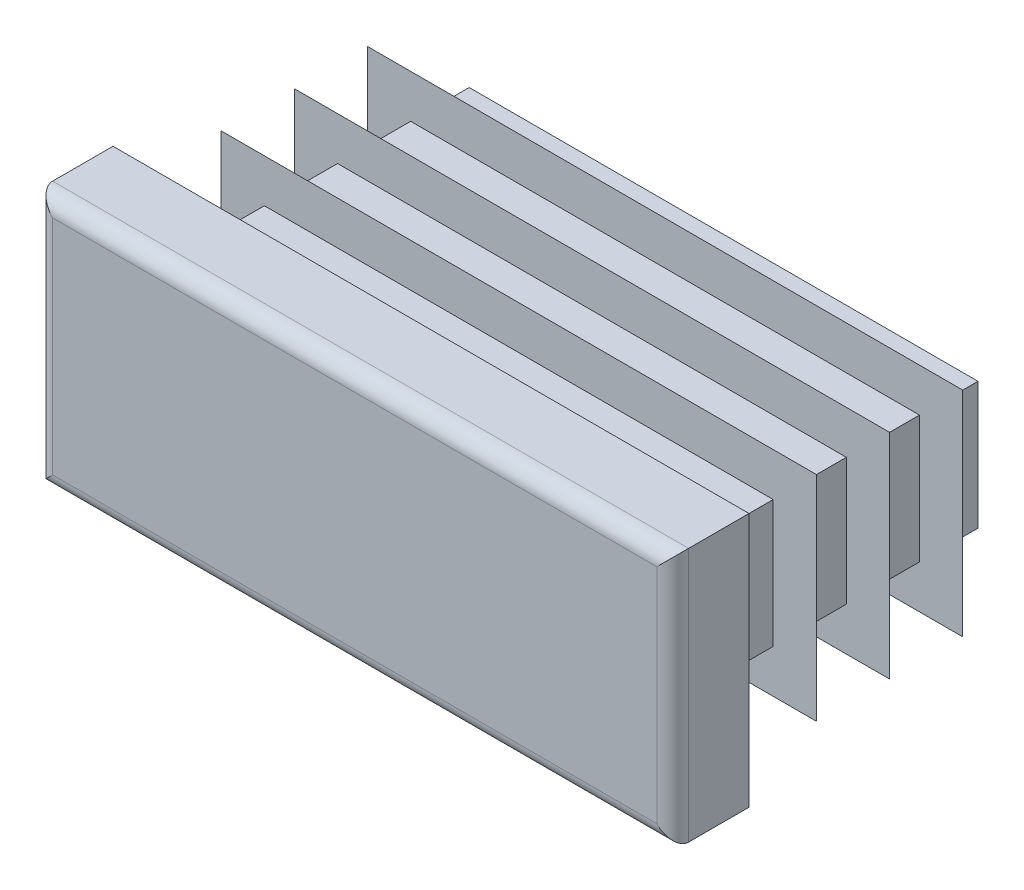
ISO-10303-21;
HEADER;
FILE_DESCRIPTION(('STEP AP214'),'2;1');
FILE_NAME('part.step','',(''),(''),'','','');
FILE_SCHEMA(('AUTOMOTIVE_DESIGN { 1 0 10303 214 1 1 1 1 }'));
ENDSEC;
DATA;
#1=APPLICATION_CONTEXT('core data for automotive mechanical design processes');
#2=APPLICATION_PROTOCOL_DEFINITION('international standard','automotive_design',2000,#1);
#3=PRODUCT_CONTEXT('',#1,'mechanical');
#4=PRODUCT('Part','Part','',(#3));
#5=PRODUCT_RELATED_PRODUCT_CATEGORY('part','',(#4));
#6=PRODUCT_DEFINITION_FORMATION('','',#4);
#7=PRODUCT_DEFINITION_CONTEXT('part definition',#1,'design');
#8=PRODUCT_DEFINITION('design','',#6,#7);
#9=PRODUCT_DEFINITION_SHAPE('','',#8);
#10=(LENGTH_UNIT() NAMED_UNIT(*) SI_UNIT(.MILLI.,.METRE.));
#11=(NAMED_UNIT(*) PLANE_ANGLE_UNIT() SI_UNIT($,.RADIAN.));
#12=(NAMED_UNIT(*) SI_UNIT($,.STERADIAN.) SOLID_ANGLE_UNIT());
#13=UNCERTAINTY_MEASURE_WITH_UNIT(LENGTH_MEASURE(1.E-05),#10,'distance_accuracy_value','');
#14=(GEOMETRIC_REPRESENTATION_CONTEXT(3) GLOBAL_UNCERTAINTY_ASSIGNED_CONTEXT((#13)) GLOBAL_UNIT_ASSIGNED_CONTEXT((#10,
#11,#12)) REPRESENTATION_CONTEXT('',''));
#15=CARTESIAN_POINT('',(0.,0.,0.));
#16=DIRECTION('',(0.,0.,1.));
#17=DIRECTION('',(1.,0.,0.));
#18=AXIS2_PLACEMENT_3D('',#15,#16,#17);
#19=CARTESIAN_POINT('',(11.875,-5.,3.));
#20=DIRECTION('',(0.,0.,-1.));
#21=DIRECTION('',(0.,1.,0.));
#22=AXIS2_PLACEMENT_3D('',#19,#20,#21);
#23=PLANE('',#22);
#24=DIRECTION('',(0.,1.,0.));
#25=VECTOR('',#24,1.);
#26=CARTESIAN_POINT('',(-11.875,-5.,3.));
#27=LINE('',#26,#25);
#28=CARTESIAN_POINT('',(-11.875,-4.375,3.));
#29=VERTEX_POINT('',#28);
#30=CARTESIAN_POINT('',(-11.875,4.375,3.));
#31=VERTEX_POINT('',#30);
#32=EDGE_CURVE('E310',#29,#31,#27,.T.);
#33=ORIENTED_EDGE('',*,*,#32,.F.);
#34=DIRECTION('',(-1.,0.,0.));
#35=VECTOR('',#34,1.);
#36=CARTESIAN_POINT('',(12.5,-4.375,3.));
#37=LINE('',#36,#35);
#38=CARTESIAN_POINT('',(11.875,-4.375,3.));
#39=VERTEX_POINT('',#38);
#40=EDGE_CURVE('E482',#39,#29,#37,.T.);
#41=ORIENTED_EDGE('',*,*,#40,.F.);
#42=DIRECTION('',(0.,1.,0.));
#43=VECTOR('',#42,1.);
#44=CARTESIAN_POINT('',(11.875,-5.,3.));
#45=LINE('',#44,#43);
#46=CARTESIAN_POINT('',(11.875,4.375,3.));
#47=VERTEX_POINT('',#46);
#48=EDGE_CURVE('E305',#39,#47,#45,.T.);
#49=ORIENTED_EDGE('',*,*,#48,.T.);
#50=DIRECTION('',(-1.,0.,0.));
#51=VECTOR('',#50,1.);
#52=CARTESIAN_POINT('',(12.5,4.375,3.));
#53=LINE('',#52,#51);
#54=EDGE_CURVE('E630',#47,#31,#53,.T.);
#55=ORIENTED_EDGE('',*,*,#54,.T.);
#56=EDGE_LOOP('',(#33,#41,#49,#55));
#57=FACE_BOUND('',#56,.T.);
#58=ADVANCED_FACE('F14',(#57),#23,.F.);
#59=CARTESIAN_POINT('',(-11.875,-5.,2.375));
#60=DIRECTION('',(0.,1.,0.));
#61=DIRECTION('',(-1.,0.,0.));
#62=AXIS2_PLACEMENT_3D('',#59,#60,#61);
#63=CYLINDRICAL_SURFACE('',#62,0.625);
#64=DIRECTION('',(0.,1.,0.));
#65=VECTOR('',#64,1.);
#66=CARTESIAN_POINT('',(-12.5,-5.,2.375));
#67=LINE('',#66,#65);
#68=CARTESIAN_POINT('',(-12.5,-5.,2.375));
#69=VERTEX_POINT('',#68);
#70=CARTESIAN_POINT('',(-12.5,5.,2.375));
#71=VERTEX_POINT('',#70);
#72=EDGE_CURVE('E402',#69,#71,#67,.T.);
#73=ORIENTED_EDGE('',*,*,#72,.F.);
#74=CARTESIAN_POINT('',(-11.875,-4.375,2.375));
#75=DIRECTION('',(-0.707106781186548,0.707106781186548,0.));
#76=DIRECTION('',(0.707106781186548,0.707106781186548,0.));
#77=AXIS2_PLACEMENT_3D('',#74,#75,#76);
#78=ELLIPSE('',#77,0.883883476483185,0.625);
#79=EDGE_CURVE('E59',#69,#29,#78,.T.);
#80=ORIENTED_EDGE('',*,*,#79,.T.);
#81=ORIENTED_EDGE('',*,*,#32,.T.);
#82=CARTESIAN_POINT('',(-11.875,4.375,2.375));
#83=DIRECTION('',(0.707106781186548,0.707106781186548,0.));
#84=DIRECTION('',(-0.707106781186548,0.707106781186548,0.));
#85=AXIS2_PLACEMENT_3D('',#82,#83,#84);
#86=ELLIPSE('',#85,0.883883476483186,0.625);
#87=EDGE_CURVE('E306',#31,#71,#86,.F.);
#88=ORIENTED_EDGE('',*,*,#87,.T.);
#89=EDGE_LOOP('',(#73,#80,#81,#88));
#90=FACE_BOUND('',#89,.T.);
#91=ADVANCED_FACE('F16',(#90),#63,.T.);
#92=CARTESIAN_POINT('',(-12.5,-5.,2.375));
#93=DIRECTION('',(1.,0.,0.));
#94=DIRECTION('',(0.,1.,0.));
#95=AXIS2_PLACEMENT_3D('',#92,#93,#94);
#96=PLANE('',#95);
#97=DIRECTION('',(0.,0.,-1.));
#98=VECTOR('',#97,1.);
#99=CARTESIAN_POINT('',(-12.5,5.,2.375));
#100=LINE('',#99,#98);
#101=CARTESIAN_POINT('',(-12.5,5.,0.));
#102=VERTEX_POINT('',#101);
#103=EDGE_CURVE('E615',#71,#102,#100,.T.);
#104=ORIENTED_EDGE('',*,*,#103,.T.);
#105=DIRECTION('',(0.,1.,0.));
#106=VECTOR('',#105,1.);
#107=CARTESIAN_POINT('',(-12.5,-5.,0.));
#108=LINE('',#107,#106);
#109=CARTESIAN_POINT('',(-12.5,-5.,0.));
#110=VERTEX_POINT('',#109);
#111=EDGE_CURVE('E400',#110,#102,#108,.T.);
#112=ORIENTED_EDGE('',*,*,#111,.F.);
#113=DIRECTION('',(0.,0.,-1.));
#114=VECTOR('',#113,1.);
#115=CARTESIAN_POINT('',(-12.5,-5.,2.375));
#116=LINE('',#115,#114);
#117=EDGE_CURVE('E616',#69,#110,#116,.T.);
#118=ORIENTED_EDGE('',*,*,#117,.F.);
#119=ORIENTED_EDGE('',*,*,#72,.T.);
#120=EDGE_LOOP('',(#104,#112,#118,#119));
#121=FACE_BOUND('',#120,.T.);
#122=ADVANCED_FACE('F697',(#121),#96,.F.);
#123=CARTESIAN_POINT('',(-10.,-5.,0.));
#124=DIRECTION('',(1.,0.,0.));
#125=DIRECTION('',(0.,1.,0.));
#126=AXIS2_PLACEMENT_3D('',#123,#124,#125);
#127=PLANE('',#126);
#128=DIRECTION('',(0.,1.,0.));
#129=VECTOR('',#128,1.);
#130=CARTESIAN_POINT('',(-10.,-5.,0.));
#131=LINE('',#130,#129);
#132=CARTESIAN_POINT('',(-10.,-2.5,0.));
#133=VERTEX_POINT('',#132);
#134=CARTESIAN_POINT('',(-10.,2.5,0.));
#135=VERTEX_POINT('',#134);
#136=EDGE_CURVE('E397',#133,#135,#131,.T.);
#137=ORIENTED_EDGE('',*,*,#136,.T.);
#138=DIRECTION('',(0.,0.,-1.));
#139=VECTOR('',#138,1.);
#140=CARTESIAN_POINT('',(-10.,2.5,0.));
#141=LINE('',#140,#139);
#142=CARTESIAN_POINT('',(-10.,2.5,-0.575));
#143=VERTEX_POINT('',#142);
#144=EDGE_CURVE('E495',#135,#143,#141,.T.);
#145=ORIENTED_EDGE('',*,*,#144,.T.);
#146=DIRECTION('',(0.,1.,0.));
#147=VECTOR('',#146,1.);
#148=CARTESIAN_POINT('',(-10.,-5.,-0.575));
#149=LINE('',#148,#147);
#150=CARTESIAN_POINT('',(-10.,-2.5,-0.575));
#151=VERTEX_POINT('',#150);
#152=EDGE_CURVE('E394',#151,#143,#149,.T.);
#153=ORIENTED_EDGE('',*,*,#152,.F.);
#154=DIRECTION('',(0.,0.,1.));
#155=VECTOR('',#154,1.);
#156=CARTESIAN_POINT('',(-10.,-2.5,0.));
#157=LINE('',#156,#155);
#158=EDGE_CURVE('E489',#151,#133,#157,.T.);
#159=ORIENTED_EDGE('',*,*,#158,.T.);
#160=EDGE_LOOP('',(#137,#145,#153,#159));
#161=FACE_BOUND('',#160,.T.);
#162=ADVANCED_FACE('F787',(#161),#127,.F.);
#163=CARTESIAN_POINT('',(-11.7,-5.,-0.575));
#164=DIRECTION('',(0.342020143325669,0.,0.939692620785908));
#165=DIRECTION('',(-0.939692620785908,0.,0.342020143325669));
#166=AXIS2_PLACEMENT_3D('',#163,#164,#165);
#167=PLANE('',#166);
#168=DIRECTION('',(0.,1.,0.));
#169=VECTOR('',#168,1.);
#170=CARTESIAN_POINT('',(-11.7,-5.,-0.575));
#171=LINE('',#170,#169);
#172=CARTESIAN_POINT('',(-11.7,-4.2,-0.575));
#173=VERTEX_POINT('',#172);
#174=CARTESIAN_POINT('',(-11.7,4.2,-0.575));
#175=VERTEX_POINT('',#174);
#176=EDGE_CURVE('E392',#173,#175,#171,.T.);
#177=ORIENTED_EDGE('',*,*,#176,.T.);
#178=DIRECTION('',(0.844349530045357,-0.438895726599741,-0.307318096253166));
#179=VECTOR('',#178,1.);
#180=CARTESIAN_POINT('',(-8.29065111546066,2.42780897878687,-1.815901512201));
#181=LINE('',#180,#179);
#182=CARTESIAN_POINT('',(-10.,3.31633428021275,-1.19374939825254));
#183=VERTEX_POINT('',#182);
#184=EDGE_CURVE('E519',#175,#183,#181,.T.);
#185=ORIENTED_EDGE('',*,*,#184,.T.);
#186=DIRECTION('',(0.,1.,0.));
#187=VECTOR('',#186,1.);
#188=CARTESIAN_POINT('',(-10.,-5.,-1.19374939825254));
#189=LINE('',#188,#187);
#190=CARTESIAN_POINT('',(-10.,-3.31633428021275,-1.19374939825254));
#191=VERTEX_POINT('',#190);
#192=EDGE_CURVE('E389',#191,#183,#189,.T.);
#193=ORIENTED_EDGE('',*,*,#192,.F.);
#194=DIRECTION('',(-0.844349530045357,-0.438895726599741,0.307318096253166));
#195=VECTOR('',#194,1.);
#196=CARTESIAN_POINT('',(-11.9964651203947,-4.35410356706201,-0.467095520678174));
#197=LINE('',#196,#195);
#198=EDGE_CURVE('E507',#191,#173,#197,.T.);
#199=ORIENTED_EDGE('',*,*,#198,.T.);
#200=EDGE_LOOP('',(#177,#185,#193,#199));
#201=FACE_BOUND('',#200,.T.);
#202=ADVANCED_FACE('F783',(#201),#167,.F.);
#203=CARTESIAN_POINT('',(-10.,-5.,-1.19374939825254));
#204=DIRECTION('',(1.,0.,0.));
#205=DIRECTION('',(0.,1.,0.));
#206=AXIS2_PLACEMENT_3D('',#203,#204,#205);
#207=PLANE('',#206);
#208=ORIENTED_EDGE('',*,*,#192,.T.);
#209=DIRECTION('',(0.,-0.819152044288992,-0.573576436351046));
#210=VECTOR('',#209,1.);
#211=CARTESIAN_POINT('',(-10.,-2.26400978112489,-5.10114837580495));
#212=LINE('',#211,#210);
#213=CARTESIAN_POINT('',(-10.,2.5,-1.7653528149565));
#214=VERTEX_POINT('',#213);
#215=EDGE_CURVE('E516',#183,#214,#212,.T.);
#216=ORIENTED_EDGE('',*,*,#215,.T.);
#217=DIRECTION('',(0.,0.,-1.));
#218=VECTOR('',#217,1.);
#219=CARTESIAN_POINT('',(-10.,2.5,-1.19374939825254));
#220=LINE('',#219,#218);
#221=CARTESIAN_POINT('',(-10.,2.5,-3.45));
#222=VERTEX_POINT('',#221);
#223=EDGE_CURVE('E525',#214,#222,#220,.T.);
#224=ORIENTED_EDGE('',*,*,#223,.T.);
#225=DIRECTION('',(0.,1.,0.));
#226=VECTOR('',#225,1.);
#227=CARTESIAN_POINT('',(-10.,-5.,-3.45));
#228=LINE('',#227,#226);
#229=CARTESIAN_POINT('',(-10.,-2.5,-3.45));
#230=VERTEX_POINT('',#229);
#231=EDGE_CURVE('E386',#230,#222,#228,.T.);
#232=ORIENTED_EDGE('',*,*,#231,.F.);
#233=DIRECTION('',(0.,0.,1.));
#234=VECTOR('',#233,1.);
#235=CARTESIAN_POINT('',(-10.,-2.5,-1.19374939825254));
#236=LINE('',#235,#234);
#237=CARTESIAN_POINT('',(-10.,-2.5,-1.7653528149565));
#238=VERTEX_POINT('',#237);
#239=EDGE_CURVE('E522',#230,#238,#236,.T.);
#240=ORIENTED_EDGE('',*,*,#239,.T.);
#241=DIRECTION('',(0.,-0.819152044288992,0.573576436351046));
#242=VECTOR('',#241,1.);
#243=CARTESIAN_POINT('',(-10.,-4.44609093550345,-0.402685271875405));
#244=LINE('',#243,#242);
#245=EDGE_CURVE('E504',#238,#191,#244,.T.);
#246=ORIENTED_EDGE('',*,*,#245,.T.);
#247=EDGE_LOOP('',(#208,#216,#224,#232,#240,#246));
#248=FACE_BOUND('',#247,.T.);
#249=ADVANCED_FACE('F779',(#248),#207,.F.);
#250=CARTESIAN_POINT('',(-11.7,-5.,-3.45));
#251=DIRECTION('',(0.342020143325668,0.,0.939692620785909));
#252=DIRECTION('',(-0.939692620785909,0.,0.342020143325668));
#253=AXIS2_PLACEMENT_3D('',#250,#251,#252);
#254=PLANE('',#253);
#255=DIRECTION('',(0.,1.,0.));
#256=VECTOR('',#255,1.);
#257=CARTESIAN_POINT('',(-11.7,-5.,-3.45));
#258=LINE('',#257,#256);
#259=CARTESIAN_POINT('',(-11.7,-4.2,-3.45));
#260=VERTEX_POINT('',#259);
#261=CARTESIAN_POINT('',(-11.7,4.2,-3.45));
#262=VERTEX_POINT('',#261);
#263=EDGE_CURVE('E384',#260,#262,#258,.T.);
#264=ORIENTED_EDGE('',*,*,#263,.T.);
#265=DIRECTION('',(0.844349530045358,-0.43889572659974,-0.307318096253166));
#266=VECTOR('',#265,1.);
#267=CARTESIAN_POINT('',(-8.29065111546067,2.42780897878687,-4.690901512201));
#268=LINE('',#267,#266);
#269=CARTESIAN_POINT('',(-10.,3.31633428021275,-4.06874939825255));
#270=VERTEX_POINT('',#269);
#271=EDGE_CURVE('E549',#262,#270,#268,.T.);
#272=ORIENTED_EDGE('',*,*,#271,.T.);
#273=DIRECTION('',(0.,1.,0.));
#274=VECTOR('',#273,1.);
#275=CARTESIAN_POINT('',(-10.,-5.,-4.06874939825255));
#276=LINE('',#275,#274);
#277=CARTESIAN_POINT('',(-10.,-3.31633428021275,-4.06874939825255));
#278=VERTEX_POINT('',#277);
#279=EDGE_CURVE('E381',#278,#270,#276,.T.);
#280=ORIENTED_EDGE('',*,*,#279,.F.);
#281=DIRECTION('',(-0.844349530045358,-0.43889572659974,0.307318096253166));
#282=VECTOR('',#281,1.);
#283=CARTESIAN_POINT('',(-11.9964651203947,-4.35410356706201,-3.34209552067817));
#284=LINE('',#283,#282);
#285=EDGE_CURVE('E537',#278,#260,#284,.T.);
#286=ORIENTED_EDGE('',*,*,#285,.T.);
#287=EDGE_LOOP('',(#264,#272,#280,#286));
#288=FACE_BOUND('',#287,.T.);
#289=ADVANCED_FACE('F775',(#288),#254,.F.);
#290=CARTESIAN_POINT('',(-10.,-5.,-4.06874939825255));
#291=DIRECTION('',(1.,0.,0.));
#292=DIRECTION('',(0.,1.,0.));
#293=AXIS2_PLACEMENT_3D('',#290,#291,#292);
#294=PLANE('',#293);
#295=ORIENTED_EDGE('',*,*,#279,.T.);
#296=DIRECTION('',(0.,-0.819152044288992,-0.573576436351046));
#297=VECTOR('',#296,1.);
#298=CARTESIAN_POINT('',(-10.,-2.26400978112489,-7.97614837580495));
#299=LINE('',#298,#297);
#300=CARTESIAN_POINT('',(-10.,2.5,-4.64035281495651));
#301=VERTEX_POINT('',#300);
#302=EDGE_CURVE('E546',#270,#301,#299,.T.);
#303=ORIENTED_EDGE('',*,*,#302,.T.);
#304=DIRECTION('',(0.,0.,-1.));
#305=VECTOR('',#304,1.);
#306=CARTESIAN_POINT('',(-10.,2.5,-4.06874939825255));
#307=LINE('',#306,#305);
#308=CARTESIAN_POINT('',(-10.,2.5,-6.325));
#309=VERTEX_POINT('',#308);
#310=EDGE_CURVE('E555',#301,#309,#307,.T.);
#311=ORIENTED_EDGE('',*,*,#310,.T.);
#312=DIRECTION('',(0.,1.,0.));
#313=VECTOR('',#312,1.);
#314=CARTESIAN_POINT('',(-10.,-5.,-6.325));
#315=LINE('',#314,#313);
#316=CARTESIAN_POINT('',(-10.,-2.5,-6.325));
#317=VERTEX_POINT('',#316);
#318=EDGE_CURVE('E378',#317,#309,#315,.T.);
#319=ORIENTED_EDGE('',*,*,#318,.F.);
#320=DIRECTION('',(0.,0.,1.));
#321=VECTOR('',#320,1.);
#322=CARTESIAN_POINT('',(-10.,-2.5,-4.06874939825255));
#323=LINE('',#322,#321);
#324=CARTESIAN_POINT('',(-10.,-2.5,-4.64035281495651));
#325=VERTEX_POINT('',#324);
#326=EDGE_CURVE('E552',#317,#325,#323,.T.);
#327=ORIENTED_EDGE('',*,*,#326,.T.);
#328=DIRECTION('',(0.,-0.819152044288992,0.573576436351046));
#329=VECTOR('',#328,1.);
#330=CARTESIAN_POINT('',(-10.,-4.44609093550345,-3.27768527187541));
#331=LINE('',#330,#329);
#332=EDGE_CURVE('E534',#325,#278,#331,.T.);
#333=ORIENTED_EDGE('',*,*,#332,.T.);
#334=EDGE_LOOP('',(#295,#303,#311,#319,#327,#333));
#335=FACE_BOUND('',#334,.T.);
#336=ADVANCED_FACE('F771',(#335),#294,.F.);
#337=CARTESIAN_POINT('',(-11.7,-5.,-6.325));
#338=DIRECTION('',(0.34202014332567,0.,0.939692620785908));
#339=DIRECTION('',(-0.939692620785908,0.,0.34202014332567));
#340=AXIS2_PLACEMENT_3D('',#337,#338,#339);
#341=PLANE('',#340);
#342=DIRECTION('',(0.,1.,0.));
#343=VECTOR('',#342,1.);
#344=CARTESIAN_POINT('',(-11.7,-5.,-6.325));
#345=LINE('',#344,#343);
#346=CARTESIAN_POINT('',(-11.7,-4.2,-6.325));
#347=VERTEX_POINT('',#346);
#348=CARTESIAN_POINT('',(-11.7,4.2,-6.325));
#349=VERTEX_POINT('',#348);
#350=EDGE_CURVE('E376',#347,#349,#345,.T.);
#351=ORIENTED_EDGE('',*,*,#350,.T.);
#352=DIRECTION('',(0.844349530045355,-0.438895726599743,-0.307318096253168));
#353=VECTOR('',#352,1.);
#354=CARTESIAN_POINT('',(-8.29065111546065,2.42780897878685,-7.56590151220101));
#355=LINE('',#354,#353);
#356=CARTESIAN_POINT('',(-10.,3.31633428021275,-6.94374939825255));
#357=VERTEX_POINT('',#356);
#358=EDGE_CURVE('E579',#349,#357,#355,.T.);
#359=ORIENTED_EDGE('',*,*,#358,.T.);
#360=DIRECTION('',(0.,1.,0.));
#361=VECTOR('',#360,1.);
#362=CARTESIAN_POINT('',(-10.,-5.,-6.94374939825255));
#363=LINE('',#362,#361);
#364=CARTESIAN_POINT('',(-10.,-3.31633428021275,-6.94374939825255));
#365=VERTEX_POINT('',#364);
#366=EDGE_CURVE('E373',#365,#357,#363,.T.);
#367=ORIENTED_EDGE('',*,*,#366,.F.);
#368=DIRECTION('',(-0.844349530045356,-0.438895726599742,0.307318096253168));
#369=VECTOR('',#368,1.);
#370=CARTESIAN_POINT('',(-11.9964651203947,-4.35410356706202,-6.21709552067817));
#371=LINE('',#370,#369);
#372=EDGE_CURVE('E567',#365,#347,#371,.T.);
#373=ORIENTED_EDGE('',*,*,#372,.T.);
#374=EDGE_LOOP('',(#351,#359,#367,#373));
#375=FACE_BOUND('',#374,.T.);
#376=ADVANCED_FACE('F767',(#375),#341,.F.);
#377=CARTESIAN_POINT('',(-10.,-5.,-6.94374939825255));
#378=DIRECTION('',(1.,0.,0.));
#379=DIRECTION('',(0.,1.,0.));
#380=AXIS2_PLACEMENT_3D('',#377,#378,#379);
#381=PLANE('',#380);
#382=ORIENTED_EDGE('',*,*,#366,.T.);
#383=DIRECTION('',(0.,-0.819152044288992,-0.573576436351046));
#384=VECTOR('',#383,1.);
#385=CARTESIAN_POINT('',(-10.,-2.26400978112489,-10.8511483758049));
#386=LINE('',#385,#384);
#387=CARTESIAN_POINT('',(-10.,2.5,-7.51535281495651));
#388=VERTEX_POINT('',#387);
#389=EDGE_CURVE('E576',#357,#388,#386,.T.);
#390=ORIENTED_EDGE('',*,*,#389,.T.);
#391=DIRECTION('',(0.,0.,-1.));
#392=VECTOR('',#391,1.);
#393=CARTESIAN_POINT('',(-10.,2.5,-6.94374939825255));
#394=LINE('',#393,#392);
#395=CARTESIAN_POINT('',(-10.,2.5,-9.2));
#396=VERTEX_POINT('',#395);
#397=EDGE_CURVE('E585',#388,#396,#394,.T.);
#398=ORIENTED_EDGE('',*,*,#397,.T.);
#399=DIRECTION('',(0.,1.,0.));
#400=VECTOR('',#399,1.);
#401=CARTESIAN_POINT('',(-10.,-5.,-9.2));
#402=LINE('',#401,#400);
#403=CARTESIAN_POINT('',(-10.,-2.5,-9.2));
#404=VERTEX_POINT('',#403);
#405=EDGE_CURVE('E370',#404,#396,#402,.T.);
#406=ORIENTED_EDGE('',*,*,#405,.F.);
#407=DIRECTION('',(0.,0.,1.));
#408=VECTOR('',#407,1.);
#409=CARTESIAN_POINT('',(-10.,-2.5,-6.94374939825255));
#410=LINE('',#409,#408);
#411=CARTESIAN_POINT('',(-10.,-2.5,-7.51535281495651));
#412=VERTEX_POINT('',#411);
#413=EDGE_CURVE('E582',#404,#412,#410,.T.);
#414=ORIENTED_EDGE('',*,*,#413,.T.);
#415=DIRECTION('',(0.,-0.819152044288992,0.573576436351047));
#416=VECTOR('',#415,1.);
#417=CARTESIAN_POINT('',(-10.,-4.44609093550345,-6.15268527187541));
#418=LINE('',#417,#416);
#419=EDGE_CURVE('E564',#412,#365,#418,.T.);
#420=ORIENTED_EDGE('',*,*,#419,.T.);
#421=EDGE_LOOP('',(#382,#390,#398,#406,#414,#420));
#422=FACE_BOUND('',#421,.T.);
#423=ADVANCED_FACE('F764',(#422),#381,.F.);
#424=CARTESIAN_POINT('',(-11.7,-5.,-9.2));
#425=DIRECTION('',(0.342020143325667,0.,0.939692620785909));
#426=DIRECTION('',(-0.939692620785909,0.,0.342020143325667));
#427=AXIS2_PLACEMENT_3D('',#424,#425,#426);
#428=PLANE('',#427);
#429=DIRECTION('',(0.,1.,0.));
#430=VECTOR('',#429,1.);
#431=CARTESIAN_POINT('',(-11.7,-5.,-9.2));
#432=LINE('',#431,#430);
#433=CARTESIAN_POINT('',(-11.7,-4.2,-9.2));
#434=VERTEX_POINT('',#433);
#435=CARTESIAN_POINT('',(-11.7,4.2,-9.2));
#436=VERTEX_POINT('',#435);
#437=EDGE_CURVE('E368',#434,#436,#432,.T.);
#438=ORIENTED_EDGE('',*,*,#437,.T.);
#439=DIRECTION('',(0.844349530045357,-0.43889572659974,-0.307318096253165));
#440=VECTOR('',#439,1.);
#441=CARTESIAN_POINT('',(-8.29065111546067,2.42780897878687,-10.440901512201));
#442=LINE('',#441,#440);
#443=CARTESIAN_POINT('',(-10.,3.31633428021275,-9.81874939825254));
#444=VERTEX_POINT('',#443);
#445=EDGE_CURVE('E607',#436,#444,#442,.T.);
#446=ORIENTED_EDGE('',*,*,#445,.T.);
#447=DIRECTION('',(0.,1.,0.));
#448=VECTOR('',#447,1.);
#449=CARTESIAN_POINT('',(-10.,-5.,-9.81874939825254));
#450=LINE('',#449,#448);
#451=CARTESIAN_POINT('',(-10.,-3.31633428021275,-9.81874939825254));
#452=VERTEX_POINT('',#451);
#453=EDGE_CURVE('E365',#452,#444,#450,.T.);
#454=ORIENTED_EDGE('',*,*,#453,.F.);
#455=DIRECTION('',(-0.844349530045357,-0.43889572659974,0.307318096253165));
#456=VECTOR('',#455,1.);
#457=CARTESIAN_POINT('',(-11.9964651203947,-4.35410356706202,-9.09209552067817));
#458=LINE('',#457,#456);
#459=EDGE_CURVE('E595',#452,#434,#458,.T.);
#460=ORIENTED_EDGE('',*,*,#459,.T.);
#461=EDGE_LOOP('',(#438,#446,#454,#460));
#462=FACE_BOUND('',#461,.T.);
#463=ADVANCED_FACE('F675',(#462),#428,.F.);
#464=CARTESIAN_POINT('',(-10.,-5.,-9.81874939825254));
#465=DIRECTION('',(1.,0.,0.));
#466=DIRECTION('',(0.,1.,0.));
#467=AXIS2_PLACEMENT_3D('',#464,#465,#466);
#468=PLANE('',#467);
#469=ORIENTED_EDGE('',*,*,#453,.T.);
#470=DIRECTION('',(0.,-0.819152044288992,-0.573576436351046));
#471=VECTOR('',#470,1.);
#472=CARTESIAN_POINT('',(-10.,-2.2640097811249,-13.7261483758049));
#473=LINE('',#472,#471);
#474=CARTESIAN_POINT('',(-10.,2.5,-10.3903528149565));
#475=VERTEX_POINT('',#474);
#476=EDGE_CURVE('E604',#444,#475,#473,.T.);
#477=ORIENTED_EDGE('',*,*,#476,.T.);
#478=DIRECTION('',(0.,0.,-1.));
#479=VECTOR('',#478,1.);
#480=CARTESIAN_POINT('',(-10.,2.5,-9.81874939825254));
#481=LINE('',#480,#479);
#482=CARTESIAN_POINT('',(-10.,2.5,-11.5));
#483=VERTEX_POINT('',#482);
#484=EDGE_CURVE('E613',#475,#483,#481,.T.);
#485=ORIENTED_EDGE('',*,*,#484,.T.);
#486=DIRECTION('',(0.,1.,0.));
#487=VECTOR('',#486,1.);
#488=CARTESIAN_POINT('',(-10.,-5.,-11.5));
#489=LINE('',#488,#487);
#490=CARTESIAN_POINT('',(-10.,-2.5,-11.5));
#491=VERTEX_POINT('',#490);
#492=EDGE_CURVE('E362',#491,#483,#489,.T.);
#493=ORIENTED_EDGE('',*,*,#492,.F.);
#494=DIRECTION('',(0.,0.,1.));
#495=VECTOR('',#494,1.);
#496=CARTESIAN_POINT('',(-10.,-2.5,-9.81874939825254));
#497=LINE('',#496,#495);
#498=CARTESIAN_POINT('',(-10.,-2.5,-10.3903528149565));
#499=VERTEX_POINT('',#498);
#500=EDGE_CURVE('E610',#491,#499,#497,.T.);
#501=ORIENTED_EDGE('',*,*,#500,.T.);
#502=DIRECTION('',(0.,-0.819152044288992,0.573576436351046));
#503=VECTOR('',#502,1.);
#504=CARTESIAN_POINT('',(-10.,-4.44609093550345,-9.02768527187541));
#505=LINE('',#504,#503);
#506=EDGE_CURVE('E592',#499,#452,#505,.T.);
#507=ORIENTED_EDGE('',*,*,#506,.T.);
#508=EDGE_LOOP('',(#469,#477,#485,#493,#501,#507));
#509=FACE_BOUND('',#508,.T.);
#510=ADVANCED_FACE('F677',(#509),#468,.F.);
#511=CARTESIAN_POINT('',(-10.,-5.,-11.5));
#512=DIRECTION('',(0.,0.,1.));
#513=DIRECTION('',(0.,-1.,0.));
#514=AXIS2_PLACEMENT_3D('',#511,#512,#513);
#515=PLANE('',#514);
#516=ORIENTED_EDGE('',*,*,#492,.T.);
#517=DIRECTION('',(-1.,0.,0.));
#518=VECTOR('',#517,1.);
#519=CARTESIAN_POINT('',(12.5,2.5,-11.5));
#520=LINE('',#519,#518);
#521=CARTESIAN_POINT('',(10.,2.5,-11.5));
#522=VERTEX_POINT('',#521);
#523=EDGE_CURVE('E438',#522,#483,#520,.T.);
#524=ORIENTED_EDGE('',*,*,#523,.F.);
#525=DIRECTION('',(0.,1.,0.));
#526=VECTOR('',#525,1.);
#527=CARTESIAN_POINT('',(10.,-5.,-11.5));
#528=LINE('',#527,#526);
#529=CARTESIAN_POINT('',(10.,-2.5,-11.5));
#530=VERTEX_POINT('',#529);
#531=EDGE_CURVE('E359',#530,#522,#528,.T.);
#532=ORIENTED_EDGE('',*,*,#531,.F.);
#533=DIRECTION('',(-1.,0.,0.));
#534=VECTOR('',#533,1.);
#535=CARTESIAN_POINT('',(12.5,-2.5,-11.5));
#536=LINE('',#535,#534);
#537=EDGE_CURVE('E436',#530,#491,#536,.T.);
#538=ORIENTED_EDGE('',*,*,#537,.T.);
#539=EDGE_LOOP('',(#516,#524,#532,#538));
#540=FACE_BOUND('',#539,.T.);
#541=ADVANCED_FACE('F435',(#540),#515,.F.);
#542=CARTESIAN_POINT('',(10.,-5.,-11.5));
#543=DIRECTION('',(-1.,0.,0.));
#544=DIRECTION('',(0.,-1.,0.));
#545=AXIS2_PLACEMENT_3D('',#542,#543,#544);
#546=PLANE('',#545);
#547=DIRECTION('',(0.,0.,1.));
#548=VECTOR('',#547,1.);
#549=CARTESIAN_POINT('',(10.,2.5,-11.5));
#550=LINE('',#549,#548);
#551=CARTESIAN_POINT('',(10.,2.5,-10.3903528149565));
#552=VERTEX_POINT('',#551);
#553=EDGE_CURVE('E9',#522,#552,#550,.T.);
#554=ORIENTED_EDGE('',*,*,#553,.T.);
#555=DIRECTION('',(0.,0.819152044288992,0.573576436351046));
#556=VECTOR('',#555,1.);
#557=CARTESIAN_POINT('',(10.,-3.05393917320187,-14.2792628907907));
#558=LINE('',#557,#556);
#559=CARTESIAN_POINT('',(10.,3.31633428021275,-9.81874939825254));
#560=VERTEX_POINT('',#559);
#561=EDGE_CURVE('E601',#552,#560,#558,.T.);
#562=ORIENTED_EDGE('',*,*,#561,.T.);
#563=DIRECTION('',(0.,1.,0.));
#564=VECTOR('',#563,1.);
#565=CARTESIAN_POINT('',(10.,-5.,-9.81874939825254));
#566=LINE('',#565,#564);
#567=CARTESIAN_POINT('',(10.,-3.31633428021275,-9.81874939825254));
#568=VERTEX_POINT('',#567);
#569=EDGE_CURVE('E356',#568,#560,#566,.T.);
#570=ORIENTED_EDGE('',*,*,#569,.F.);
#571=DIRECTION('',(0.,0.819152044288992,-0.573576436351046));
#572=VECTOR('',#571,1.);
#573=CARTESIAN_POINT('',(10.,-3.65616154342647,-9.58079978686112));
#574=LINE('',#573,#572);
#575=CARTESIAN_POINT('',(10.,-2.5,-10.3903528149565));
#576=VERTEX_POINT('',#575);
#577=EDGE_CURVE('E428',#568,#576,#574,.T.);
#578=ORIENTED_EDGE('',*,*,#577,.T.);
#579=DIRECTION('',(0.,0.,-1.));
#580=VECTOR('',#579,1.);
#581=CARTESIAN_POINT('',(10.,-2.5,-11.5));
#582=LINE('',#581,#580);
#583=EDGE_CURVE('E23',#576,#530,#582,.T.);
#584=ORIENTED_EDGE('',*,*,#583,.T.);
#585=ORIENTED_EDGE('',*,*,#531,.T.);
#586=EDGE_LOOP('',(#554,#562,#570,#578,#584,#585));
#587=FACE_BOUND('',#586,.T.);
#588=ADVANCED_FACE('F426',(#587),#546,.F.);
#589=CARTESIAN_POINT('',(10.,-5.,-9.81874939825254));
#590=DIRECTION('',(-0.342020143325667,0.,0.939692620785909));
#591=DIRECTION('',(-0.939692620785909,0.,-0.342020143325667));
#592=AXIS2_PLACEMENT_3D('',#589,#590,#591);
#593=PLANE('',#592);
#594=ORIENTED_EDGE('',*,*,#569,.T.);
#595=DIRECTION('',(0.844349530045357,0.43889572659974,0.307318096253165));
#596=VECTOR('',#595,1.);
#597=CARTESIAN_POINT('',(6.91812119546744,1.71436330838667,-10.9404615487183));
#598=LINE('',#597,#596);
#599=CARTESIAN_POINT('',(11.7,4.2,-9.2));
#600=VERTEX_POINT('',#599);
#601=EDGE_CURVE('E598',#560,#600,#598,.T.);
#602=ORIENTED_EDGE('',*,*,#601,.T.);
#603=DIRECTION('',(0.,1.,0.));
#604=VECTOR('',#603,1.);
#605=CARTESIAN_POINT('',(11.7,-5.,-9.2));
#606=LINE('',#605,#604);
#607=CARTESIAN_POINT('',(11.7,-4.2,-9.2));
#608=VERTEX_POINT('',#607);
#609=EDGE_CURVE('E353',#608,#600,#606,.T.);
#610=ORIENTED_EDGE('',*,*,#609,.F.);
#611=DIRECTION('',(-0.844349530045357,0.43889572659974,-0.307318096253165));
#612=VECTOR('',#611,1.);
#613=CARTESIAN_POINT('',(10.6239352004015,-3.6406578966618,-9.59165555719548));
#614=LINE('',#613,#612);
#615=EDGE_CURVE('E588',#608,#568,#614,.T.);
#616=ORIENTED_EDGE('',*,*,#615,.T.);
#617=EDGE_LOOP('',(#594,#602,#610,#616));
#618=FACE_BOUND('',#617,.T.);
#619=ADVANCED_FACE('F752',(#618),#593,.F.);
#620=CARTESIAN_POINT('',(11.7,-5.,-9.2));
#621=DIRECTION('',(0.,0.,-1.));
#622=DIRECTION('',(0.,1.,0.));
#623=AXIS2_PLACEMENT_3D('',#620,#621,#622);
#624=PLANE('',#623);
#625=ORIENTED_EDGE('',*,*,#609,.T.);
#626=DIRECTION('',(-1.,0.,0.));
#627=VECTOR('',#626,1.);
#628=CARTESIAN_POINT('',(12.5,4.2,-9.2));
#629=LINE('',#628,#627);
#630=EDGE_CURVE('E444',#600,#436,#629,.T.);
#631=ORIENTED_EDGE('',*,*,#630,.T.);
#632=ORIENTED_EDGE('',*,*,#437,.F.);
#633=DIRECTION('',(-1.,0.,0.));
#634=VECTOR('',#633,1.);
#635=CARTESIAN_POINT('',(12.5,-4.2,-9.2));
#636=LINE('',#635,#634);
#637=EDGE_CURVE('E451',#608,#434,#636,.T.);
#638=ORIENTED_EDGE('',*,*,#637,.F.);
#639=EDGE_LOOP('',(#625,#631,#632,#638));
#640=FACE_BOUND('',#639,.T.);
#641=ORIENTED_EDGE('',*,*,#405,.T.);
#642=DIRECTION('',(-1.,0.,0.));
#643=VECTOR('',#642,1.);
#644=CARTESIAN_POINT('',(12.5,2.5,-9.2));
#645=LINE('',#644,#643);
#646=CARTESIAN_POINT('',(10.,2.5,-9.2));
#647=VERTEX_POINT('',#646);
#648=EDGE_CURVE('E663',#647,#396,#645,.T.);
#649=ORIENTED_EDGE('',*,*,#648,.F.);
#650=DIRECTION('',(0.,1.,0.));
#651=VECTOR('',#650,1.);
#652=CARTESIAN_POINT('',(10.,-5.,-9.2));
#653=LINE('',#652,#651);
#654=CARTESIAN_POINT('',(10.,-2.5,-9.2));
#655=VERTEX_POINT('',#654);
#656=EDGE_CURVE('E350',#655,#647,#653,.T.);
#657=ORIENTED_EDGE('',*,*,#656,.F.);
#658=DIRECTION('',(-1.,0.,0.));
#659=VECTOR('',#658,1.);
#660=CARTESIAN_POINT('',(12.5,-2.5,-9.2));
#661=LINE('',#660,#659);
#662=EDGE_CURVE('E453',#655,#404,#661,.T.);
#663=ORIENTED_EDGE('',*,*,#662,.T.);
#664=EDGE_LOOP('',(#641,#649,#657,#663));
#665=FACE_BOUND('',#664,.T.);
#666=ADVANCED_FACE('F667',(#640,#665),#624,.F.);
#667=CARTESIAN_POINT('',(10.,-5.,-9.2));
#668=DIRECTION('',(-1.,0.,0.));
#669=DIRECTION('',(0.,-1.,0.));
#670=AXIS2_PLACEMENT_3D('',#667,#668,#669);
#671=PLANE('',#670);
#672=DIRECTION('',(0.,0.,1.));
#673=VECTOR('',#672,1.);
#674=CARTESIAN_POINT('',(10.,2.5,-9.2));
#675=LINE('',#674,#673);
#676=CARTESIAN_POINT('',(10.,2.5,-7.51535281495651));
#677=VERTEX_POINT('',#676);
#678=EDGE_CURVE('E420',#647,#677,#675,.T.);
#679=ORIENTED_EDGE('',*,*,#678,.T.);
#680=DIRECTION('',(0.,0.819152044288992,0.573576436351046));
#681=VECTOR('',#680,1.);
#682=CARTESIAN_POINT('',(10.,-3.32410080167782,-11.5934320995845));
#683=LINE('',#682,#681);
#684=CARTESIAN_POINT('',(10.,3.31633428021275,-6.94374939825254));
#685=VERTEX_POINT('',#684);
#686=EDGE_CURVE('E573',#677,#685,#683,.T.);
#687=ORIENTED_EDGE('',*,*,#686,.T.);
#688=DIRECTION('',(0.,1.,0.));
#689=VECTOR('',#688,1.);
#690=CARTESIAN_POINT('',(10.,-5.,-6.94374939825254));
#691=LINE('',#690,#689);
#692=CARTESIAN_POINT('',(10.,-3.31633428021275,-6.94374939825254));
#693=VERTEX_POINT('',#692);
#694=EDGE_CURVE('E347',#693,#685,#691,.T.);
#695=ORIENTED_EDGE('',*,*,#694,.F.);
#696=DIRECTION('',(0.,0.819152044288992,-0.573576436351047));
#697=VECTOR('',#696,1.);
#698=CARTESIAN_POINT('',(10.,-3.38599991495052,-6.89496899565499));
#699=LINE('',#698,#697);
#700=CARTESIAN_POINT('',(10.,-2.5,-7.51535281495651));
#701=VERTEX_POINT('',#700);
#702=EDGE_CURVE('E561',#693,#701,#699,.T.);
#703=ORIENTED_EDGE('',*,*,#702,.T.);
#704=DIRECTION('',(0.,0.,-1.));
#705=VECTOR('',#704,1.);
#706=CARTESIAN_POINT('',(10.,-2.5,-9.2));
#707=LINE('',#706,#705);
#708=EDGE_CURVE('E417',#701,#655,#707,.T.);
#709=ORIENTED_EDGE('',*,*,#708,.T.);
#710=ORIENTED_EDGE('',*,*,#656,.T.);
#711=EDGE_LOOP('',(#679,#687,#695,#703,#709,#710));
#712=FACE_BOUND('',#711,.T.);
#713=ADVANCED_FACE('F745',(#712),#671,.F.);
#714=CARTESIAN_POINT('',(10.,-5.,-6.94374939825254));
#715=DIRECTION('',(-0.342020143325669,0.,0.939692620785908));
#716=DIRECTION('',(-0.939692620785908,0.,-0.342020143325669));
#717=AXIS2_PLACEMENT_3D('',#714,#715,#716);
#718=PLANE('',#717);
#719=ORIENTED_EDGE('',*,*,#694,.T.);
#720=DIRECTION('',(0.844349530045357,0.438895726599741,0.307318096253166));
#721=VECTOR('',#720,1.);
#722=CARTESIAN_POINT('',(6.91812119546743,1.71436330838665,-8.06546154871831));
#723=LINE('',#722,#721);
#724=CARTESIAN_POINT('',(11.7,4.2,-6.325));
#725=VERTEX_POINT('',#724);
#726=EDGE_CURVE('E570',#685,#725,#723,.T.);
#727=ORIENTED_EDGE('',*,*,#726,.T.);
#728=DIRECTION('',(0.,1.,0.));
#729=VECTOR('',#728,1.);
#730=CARTESIAN_POINT('',(11.7,-5.,-6.325));
#731=LINE('',#730,#729);
#732=CARTESIAN_POINT('',(11.7,-4.2,-6.325));
#733=VERTEX_POINT('',#732);
#734=EDGE_CURVE('E344',#733,#725,#731,.T.);
#735=ORIENTED_EDGE('',*,*,#734,.F.);
#736=DIRECTION('',(-0.844349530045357,0.43889572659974,-0.307318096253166));
#737=VECTOR('',#736,1.);
#738=CARTESIAN_POINT('',(10.6239352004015,-3.6406578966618,-6.71665555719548));
#739=LINE('',#738,#737);
#740=EDGE_CURVE('E558',#733,#693,#739,.T.);
#741=ORIENTED_EDGE('',*,*,#740,.T.);
#742=EDGE_LOOP('',(#719,#727,#735,#741));
#743=FACE_BOUND('',#742,.T.);
#744=ADVANCED_FACE('F741',(#743),#718,.F.);
#745=CARTESIAN_POINT('',(11.7,-5.,-6.325));
#746=DIRECTION('',(0.,0.,-1.));
#747=DIRECTION('',(0.,1.,0.));
#748=AXIS2_PLACEMENT_3D('',#745,#746,#747);
#749=PLANE('',#748);
#750=ORIENTED_EDGE('',*,*,#734,.T.);
#751=DIRECTION('',(-1.,0.,0.));
#752=VECTOR('',#751,1.);
#753=CARTESIAN_POINT('',(12.5,4.2,-6.325));
#754=LINE('',#753,#752);
#755=EDGE_CURVE('E657',#725,#349,#754,.T.);
#756=ORIENTED_EDGE('',*,*,#755,.T.);
#757=ORIENTED_EDGE('',*,*,#350,.F.);
#758=DIRECTION('',(-1.,0.,0.));
#759=VECTOR('',#758,1.);
#760=CARTESIAN_POINT('',(12.5,-4.2,-6.325));
#761=LINE('',#760,#759);
#762=EDGE_CURVE('E459',#733,#347,#761,.T.);
#763=ORIENTED_EDGE('',*,*,#762,.F.);
#764=EDGE_LOOP('',(#750,#756,#757,#763));
#765=FACE_BOUND('',#764,.T.);
#766=ORIENTED_EDGE('',*,*,#318,.T.);
#767=DIRECTION('',(-1.,0.,0.));
#768=VECTOR('',#767,1.);
#769=CARTESIAN_POINT('',(12.5,2.5,-6.325));
#770=LINE('',#769,#768);
#771=CARTESIAN_POINT('',(10.,2.5,-6.325));
#772=VERTEX_POINT('',#771);
#773=EDGE_CURVE('E655',#772,#309,#770,.T.);
#774=ORIENTED_EDGE('',*,*,#773,.F.);
#775=DIRECTION('',(0.,1.,0.));
#776=VECTOR('',#775,1.);
#777=CARTESIAN_POINT('',(10.,-5.,-6.325));
#778=LINE('',#777,#776);
#779=CARTESIAN_POINT('',(10.,-2.5,-6.325));
#780=VERTEX_POINT('',#779);
#781=EDGE_CURVE('E341',#780,#772,#778,.T.);
#782=ORIENTED_EDGE('',*,*,#781,.F.);
#783=DIRECTION('',(-1.,0.,0.));
#784=VECTOR('',#783,1.);
#785=CARTESIAN_POINT('',(12.5,-2.5,-6.325));
#786=LINE('',#785,#784);
#787=EDGE_CURVE('E461',#780,#317,#786,.T.);
#788=ORIENTED_EDGE('',*,*,#787,.T.);
#789=EDGE_LOOP('',(#766,#774,#782,#788));
#790=FACE_BOUND('',#789,.T.);
#791=ADVANCED_FACE('F737',(#765,#790),#749,.F.);
#792=CARTESIAN_POINT('',(10.,-5.,-6.325));
#793=DIRECTION('',(-1.,0.,0.));
#794=DIRECTION('',(0.,-1.,0.));
#795=AXIS2_PLACEMENT_3D('',#792,#793,#794);
#796=PLANE('',#795);
#797=DIRECTION('',(0.,0.,1.));
#798=VECTOR('',#797,1.);
#799=CARTESIAN_POINT('',(10.,2.5,-6.325));
#800=LINE('',#799,#798);
#801=CARTESIAN_POINT('',(10.,2.5,-4.64035281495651));
#802=VERTEX_POINT('',#801);
#803=EDGE_CURVE('E414',#772,#802,#800,.T.);
#804=ORIENTED_EDGE('',*,*,#803,.T.);
#805=DIRECTION('',(0.,0.819152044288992,0.573576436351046));
#806=VECTOR('',#805,1.);
#807=CARTESIAN_POINT('',(10.,-3.32410080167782,-8.71843209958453));
#808=LINE('',#807,#806);
#809=CARTESIAN_POINT('',(10.,3.31633428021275,-4.06874939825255));
#810=VERTEX_POINT('',#809);
#811=EDGE_CURVE('E543',#802,#810,#808,.T.);
#812=ORIENTED_EDGE('',*,*,#811,.T.);
#813=DIRECTION('',(0.,1.,0.));
#814=VECTOR('',#813,1.);
#815=CARTESIAN_POINT('',(10.,-5.,-4.06874939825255));
#816=LINE('',#815,#814);
#817=CARTESIAN_POINT('',(10.,-3.31633428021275,-4.06874939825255));
#818=VERTEX_POINT('',#817);
#819=EDGE_CURVE('E338',#818,#810,#816,.T.);
#820=ORIENTED_EDGE('',*,*,#819,.F.);
#821=DIRECTION('',(0.,0.819152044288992,-0.573576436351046));
#822=VECTOR('',#821,1.);
#823=CARTESIAN_POINT('',(10.,-3.38599991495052,-4.01996899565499));
#824=LINE('',#823,#822);
#825=CARTESIAN_POINT('',(10.,-2.5,-4.64035281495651));
#826=VERTEX_POINT('',#825);
#827=EDGE_CURVE('E531',#818,#826,#824,.T.);
#828=ORIENTED_EDGE('',*,*,#827,.T.);
#829=DIRECTION('',(0.,0.,-1.));
#830=VECTOR('',#829,1.);
#831=CARTESIAN_POINT('',(10.,-2.5,-6.325));
#832=LINE('',#831,#830);
#833=EDGE_CURVE('E411',#826,#780,#832,.T.);
#834=ORIENTED_EDGE('',*,*,#833,.T.);
#835=ORIENTED_EDGE('',*,*,#781,.T.);
#836=EDGE_LOOP('',(#804,#812,#820,#828,#834,#835));
#837=FACE_BOUND('',#836,.T.);
#838=ADVANCED_FACE('F733',(#837),#796,.F.);
#839=CARTESIAN_POINT('',(10.,-5.,-4.06874939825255));
#840=DIRECTION('',(-0.342020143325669,0.,0.939692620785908));
#841=DIRECTION('',(-0.939692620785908,0.,-0.342020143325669));
#842=AXIS2_PLACEMENT_3D('',#839,#840,#841);
#843=PLANE('',#842);
#844=ORIENTED_EDGE('',*,*,#819,.T.);
#845=DIRECTION('',(0.844349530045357,0.438895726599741,0.307318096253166));
#846=VECTOR('',#845,1.);
#847=CARTESIAN_POINT('',(6.91812119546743,1.71436330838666,-5.19046154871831));
#848=LINE('',#847,#846);
#849=CARTESIAN_POINT('',(11.7,4.2,-3.45));
#850=VERTEX_POINT('',#849);
#851=EDGE_CURVE('E540',#810,#850,#848,.T.);
#852=ORIENTED_EDGE('',*,*,#851,.T.);
#853=DIRECTION('',(0.,1.,0.));
#854=VECTOR('',#853,1.);
#855=CARTESIAN_POINT('',(11.7,-5.,-3.45));
#856=LINE('',#855,#854);
#857=CARTESIAN_POINT('',(11.7,-4.2,-3.45));
#858=VERTEX_POINT('',#857);
#859=EDGE_CURVE('E335',#858,#850,#856,.T.);
#860=ORIENTED_EDGE('',*,*,#859,.F.);
#861=DIRECTION('',(-0.844349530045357,0.438895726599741,-0.307318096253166));
#862=VECTOR('',#861,1.);
#863=CARTESIAN_POINT('',(10.6239352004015,-3.6406578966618,-3.84165555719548));
#864=LINE('',#863,#862);
#865=EDGE_CURVE('E528',#858,#818,#864,.T.);
#866=ORIENTED_EDGE('',*,*,#865,.T.);
#867=EDGE_LOOP('',(#844,#852,#860,#866));
#868=FACE_BOUND('',#867,.T.);
#869=ADVANCED_FACE('F729',(#868),#843,.F.);
#870=CARTESIAN_POINT('',(11.7,-5.,-3.45));
#871=DIRECTION('',(0.,0.,-1.));
#872=DIRECTION('',(0.,1.,0.));
#873=AXIS2_PLACEMENT_3D('',#870,#871,#872);
#874=PLANE('',#873);
#875=ORIENTED_EDGE('',*,*,#859,.T.);
#876=DIRECTION('',(-1.,0.,0.));
#877=VECTOR('',#876,1.);
#878=CARTESIAN_POINT('',(12.5,4.2,-3.45));
#879=LINE('',#878,#877);
#880=EDGE_CURVE('E649',#850,#262,#879,.T.);
#881=ORIENTED_EDGE('',*,*,#880,.T.);
#882=ORIENTED_EDGE('',*,*,#263,.F.);
#883=DIRECTION('',(-1.,0.,0.));
#884=VECTOR('',#883,1.);
#885=CARTESIAN_POINT('',(12.5,-4.2,-3.45));
#886=LINE('',#885,#884);
#887=EDGE_CURVE('E467',#858,#260,#886,.T.);
#888=ORIENTED_EDGE('',*,*,#887,.F.);
#889=EDGE_LOOP('',(#875,#881,#882,#888));
#890=FACE_BOUND('',#889,.T.);
#891=ORIENTED_EDGE('',*,*,#231,.T.);
#892=DIRECTION('',(-1.,0.,0.));
#893=VECTOR('',#892,1.);
#894=CARTESIAN_POINT('',(12.5,2.5,-3.45));
#895=LINE('',#894,#893);
#896=CARTESIAN_POINT('',(10.,2.5,-3.45));
#897=VERTEX_POINT('',#896);
#898=EDGE_CURVE('E647',#897,#222,#895,.T.);
#899=ORIENTED_EDGE('',*,*,#898,.F.);
#900=DIRECTION('',(0.,1.,0.));
#901=VECTOR('',#900,1.);
#902=CARTESIAN_POINT('',(10.,-5.,-3.45));
#903=LINE('',#902,#901);
#904=CARTESIAN_POINT('',(10.,-2.5,-3.45));
#905=VERTEX_POINT('',#904);
#906=EDGE_CURVE('E332',#905,#897,#903,.T.);
#907=ORIENTED_EDGE('',*,*,#906,.F.);
#908=DIRECTION('',(-1.,0.,0.));
#909=VECTOR('',#908,1.);
#910=CARTESIAN_POINT('',(12.5,-2.5,-3.45));
#911=LINE('',#910,#909);
#912=EDGE_CURVE('E469',#905,#230,#911,.T.);
#913=ORIENTED_EDGE('',*,*,#912,.T.);
#914=EDGE_LOOP('',(#891,#899,#907,#913));
#915=FACE_BOUND('',#914,.T.);
#916=ADVANCED_FACE('F725',(#890,#915),#874,.F.);
#917=CARTESIAN_POINT('',(10.,-5.,-3.45));
#918=DIRECTION('',(-1.,0.,0.));
#919=DIRECTION('',(0.,-1.,0.));
#920=AXIS2_PLACEMENT_3D('',#917,#918,#919);
#921=PLANE('',#920);
#922=DIRECTION('',(0.,0.,1.));
#923=VECTOR('',#922,1.);
#924=CARTESIAN_POINT('',(10.,2.5,-3.45));
#925=LINE('',#924,#923);
#926=CARTESIAN_POINT('',(10.,2.5,-1.7653528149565));
#927=VERTEX_POINT('',#926);
#928=EDGE_CURVE('E408',#897,#927,#925,.T.);
#929=ORIENTED_EDGE('',*,*,#928,.T.);
#930=DIRECTION('',(0.,0.819152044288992,0.573576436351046));
#931=VECTOR('',#930,1.);
#932=CARTESIAN_POINT('',(10.,-3.32410080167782,-5.84343209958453));
#933=LINE('',#932,#931);
#934=CARTESIAN_POINT('',(10.,3.31633428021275,-1.19374939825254));
#935=VERTEX_POINT('',#934);
#936=EDGE_CURVE('E513',#927,#935,#933,.T.);
#937=ORIENTED_EDGE('',*,*,#936,.T.);
#938=DIRECTION('',(0.,1.,0.));
#939=VECTOR('',#938,1.);
#940=CARTESIAN_POINT('',(10.,-5.,-1.19374939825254));
#941=LINE('',#940,#939);
#942=CARTESIAN_POINT('',(10.,-3.31633428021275,-1.19374939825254));
#943=VERTEX_POINT('',#942);
#944=EDGE_CURVE('E329',#943,#935,#941,.T.);
#945=ORIENTED_EDGE('',*,*,#944,.F.);
#946=DIRECTION('',(0.,0.819152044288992,-0.573576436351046));
#947=VECTOR('',#946,1.);
#948=CARTESIAN_POINT('',(10.,-3.38599991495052,-1.14496899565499));
#949=LINE('',#948,#947);
#950=CARTESIAN_POINT('',(10.,-2.5,-1.7653528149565));
#951=VERTEX_POINT('',#950);
#952=EDGE_CURVE('E501',#943,#951,#949,.T.);
#953=ORIENTED_EDGE('',*,*,#952,.T.);
#954=DIRECTION('',(0.,0.,-1.));
#955=VECTOR('',#954,1.);
#956=CARTESIAN_POINT('',(10.,-2.5,-3.45));
#957=LINE('',#956,#955);
#958=EDGE_CURVE('E405',#951,#905,#957,.T.);
#959=ORIENTED_EDGE('',*,*,#958,.T.);
#960=ORIENTED_EDGE('',*,*,#906,.T.);
#961=EDGE_LOOP('',(#929,#937,#945,#953,#959,#960));
#962=FACE_BOUND('',#961,.T.);
#963=ADVANCED_FACE('F721',(#962),#921,.F.);
#964=CARTESIAN_POINT('',(10.,-5.,-1.19374939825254));
#965=DIRECTION('',(-0.342020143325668,0.,0.939692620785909));
#966=DIRECTION('',(-0.939692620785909,0.,-0.342020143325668));
#967=AXIS2_PLACEMENT_3D('',#964,#965,#966);
#968=PLANE('',#967);
#969=ORIENTED_EDGE('',*,*,#944,.T.);
#970=DIRECTION('',(0.844349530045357,0.438895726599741,0.307318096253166));
#971=VECTOR('',#970,1.);
#972=CARTESIAN_POINT('',(6.91812119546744,1.71436330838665,-2.31546154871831));
#973=LINE('',#972,#971);
#974=CARTESIAN_POINT('',(11.7,4.2,-0.575));
#975=VERTEX_POINT('',#974);
#976=EDGE_CURVE('E510',#935,#975,#973,.T.);
#977=ORIENTED_EDGE('',*,*,#976,.T.);
#978=DIRECTION('',(0.,1.,0.));
#979=VECTOR('',#978,1.);
#980=CARTESIAN_POINT('',(11.7,-5.,-0.575));
#981=LINE('',#980,#979);
#982=CARTESIAN_POINT('',(11.7,-4.2,-0.575));
#983=VERTEX_POINT('',#982);
#984=EDGE_CURVE('E326',#983,#975,#981,.T.);
#985=ORIENTED_EDGE('',*,*,#984,.F.);
#986=DIRECTION('',(-0.844349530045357,0.438895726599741,-0.307318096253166));
#987=VECTOR('',#986,1.);
#988=CARTESIAN_POINT('',(10.6239352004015,-3.6406578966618,-0.96665555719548));
#989=LINE('',#988,#987);
#990=EDGE_CURVE('E498',#983,#943,#989,.T.);
#991=ORIENTED_EDGE('',*,*,#990,.T.);
#992=EDGE_LOOP('',(#969,#977,#985,#991));
#993=FACE_BOUND('',#992,.T.);
#994=ADVANCED_FACE('F717',(#993),#968,.F.);
#995=CARTESIAN_POINT('',(11.7,-5.,-0.575));
#996=DIRECTION('',(0.,0.,-1.));
#997=DIRECTION('',(0.,1.,0.));
#998=AXIS2_PLACEMENT_3D('',#995,#996,#997);
#999=PLANE('',#998);
#1000=ORIENTED_EDGE('',*,*,#984,.T.);
#1001=DIRECTION('',(-1.,0.,0.));
#1002=VECTOR('',#1001,1.);
#1003=CARTESIAN_POINT('',(12.5,4.2,-0.575));
#1004=LINE('',#1003,#1002);
#1005=EDGE_CURVE('E641',#975,#175,#1004,.T.);
#1006=ORIENTED_EDGE('',*,*,#1005,.T.);
#1007=ORIENTED_EDGE('',*,*,#176,.F.);
#1008=DIRECTION('',(-1.,0.,0.));
#1009=VECTOR('',#1008,1.);
#1010=CARTESIAN_POINT('',(12.5,-4.2,-0.575));
#1011=LINE('',#1010,#1009);
#1012=EDGE_CURVE('E475',#983,#173,#1011,.T.);
#1013=ORIENTED_EDGE('',*,*,#1012,.F.);
#1014=EDGE_LOOP('',(#1000,#1006,#1007,#1013));
#1015=FACE_BOUND('',#1014,.T.);
#1016=ORIENTED_EDGE('',*,*,#152,.T.);
#1017=DIRECTION('',(-1.,0.,0.));
#1018=VECTOR('',#1017,1.);
#1019=CARTESIAN_POINT('',(12.5,2.5,-0.575));
#1020=LINE('',#1019,#1018);
#1021=CARTESIAN_POINT('',(10.,2.5,-0.575));
#1022=VERTEX_POINT('',#1021);
#1023=EDGE_CURVE('E639',#1022,#143,#1020,.T.);
#1024=ORIENTED_EDGE('',*,*,#1023,.F.);
#1025=DIRECTION('',(0.,1.,0.));
#1026=VECTOR('',#1025,1.);
#1027=CARTESIAN_POINT('',(10.,-5.,-0.575));
#1028=LINE('',#1027,#1026);
#1029=CARTESIAN_POINT('',(10.,-2.5,-0.575));
#1030=VERTEX_POINT('',#1029);
#1031=EDGE_CURVE('E323',#1030,#1022,#1028,.T.);
#1032=ORIENTED_EDGE('',*,*,#1031,.F.);
#1033=DIRECTION('',(-1.,0.,0.));
#1034=VECTOR('',#1033,1.);
#1035=CARTESIAN_POINT('',(12.5,-2.5,-0.575));
#1036=LINE('',#1035,#1034);
#1037=EDGE_CURVE('E477',#1030,#151,#1036,.T.);
#1038=ORIENTED_EDGE('',*,*,#1037,.T.);
#1039=EDGE_LOOP('',(#1016,#1024,#1032,#1038));
#1040=FACE_BOUND('',#1039,.T.);
#1041=ADVANCED_FACE('F713',(#1015,#1040),#999,.F.);
#1042=CARTESIAN_POINT('',(10.,-5.,-0.575));
#1043=DIRECTION('',(-1.,0.,0.));
#1044=DIRECTION('',(0.,-1.,0.));
#1045=AXIS2_PLACEMENT_3D('',#1042,#1043,#1044);
#1046=PLANE('',#1045);
#1047=ORIENTED_EDGE('',*,*,#1031,.T.);
#1048=DIRECTION('',(0.,0.,1.));
#1049=VECTOR('',#1048,1.);
#1050=CARTESIAN_POINT('',(10.,2.5,-0.575));
#1051=LINE('',#1050,#1049);
#1052=CARTESIAN_POINT('',(10.,2.5,0.));
#1053=VERTEX_POINT('',#1052);
#1054=EDGE_CURVE('E492',#1022,#1053,#1051,.T.);
#1055=ORIENTED_EDGE('',*,*,#1054,.T.);
#1056=DIRECTION('',(0.,1.,0.));
#1057=VECTOR('',#1056,1.);
#1058=CARTESIAN_POINT('',(10.,-5.,0.));
#1059=LINE('',#1058,#1057);
#1060=CARTESIAN_POINT('',(10.,-2.5,0.));
#1061=VERTEX_POINT('',#1060);
#1062=EDGE_CURVE('E316',#1061,#1053,#1059,.T.);
#1063=ORIENTED_EDGE('',*,*,#1062,.F.);
#1064=DIRECTION('',(0.,0.,-1.));
#1065=VECTOR('',#1064,1.);
#1066=CARTESIAN_POINT('',(10.,-2.5,-0.575));
#1067=LINE('',#1066,#1065);
#1068=EDGE_CURVE('E486',#1061,#1030,#1067,.T.);
#1069=ORIENTED_EDGE('',*,*,#1068,.T.);
#1070=EDGE_LOOP('',(#1047,#1055,#1063,#1069));
#1071=FACE_BOUND('',#1070,.T.);
#1072=ADVANCED_FACE('F709',(#1071),#1046,.F.);
#1073=CARTESIAN_POINT('',(10.,-5.,0.));
#1074=DIRECTION('',(0.,0.,1.));
#1075=DIRECTION('',(0.,-1.,0.));
#1076=AXIS2_PLACEMENT_3D('',#1073,#1074,#1075);
#1077=PLANE('',#1076);
#1078=DIRECTION('',(-1.,0.,0.));
#1079=VECTOR('',#1078,1.);
#1080=CARTESIAN_POINT('',(12.5,2.5,0.));
#1081=LINE('',#1080,#1079);
#1082=EDGE_CURVE('E634',#1053,#135,#1081,.T.);
#1083=ORIENTED_EDGE('',*,*,#1082,.T.);
#1084=ORIENTED_EDGE('',*,*,#136,.F.);
#1085=DIRECTION('',(-1.,0.,0.));
#1086=VECTOR('',#1085,1.);
#1087=CARTESIAN_POINT('',(12.5,-2.5,0.));
#1088=LINE('',#1087,#1086);
#1089=EDGE_CURVE('E296',#1061,#133,#1088,.T.);
#1090=ORIENTED_EDGE('',*,*,#1089,.F.);
#1091=ORIENTED_EDGE('',*,*,#1062,.T.);
#1092=EDGE_LOOP('',(#1083,#1084,#1090,#1091));
#1093=FACE_BOUND('',#1092,.T.);
#1094=ORIENTED_EDGE('',*,*,#111,.T.);
#1095=DIRECTION('',(1.,0.,0.));
#1096=VECTOR('',#1095,1.);
#1097=CARTESIAN_POINT('',(10.,5.,0.));
#1098=LINE('',#1097,#1096);
#1099=CARTESIAN_POINT('',(12.5,5.,0.));
#1100=VERTEX_POINT('',#1099);
#1101=EDGE_CURVE('E621',#102,#1100,#1098,.T.);
#1102=ORIENTED_EDGE('',*,*,#1101,.T.);
#1103=DIRECTION('',(0.,1.,0.));
#1104=VECTOR('',#1103,1.);
#1105=CARTESIAN_POINT('',(12.5,-5.,0.));
#1106=LINE('',#1105,#1104);
#1107=CARTESIAN_POINT('',(12.5,-5.,0.));
#1108=VERTEX_POINT('',#1107);
#1109=EDGE_CURVE('E45',#1108,#1100,#1106,.T.);
#1110=ORIENTED_EDGE('',*,*,#1109,.F.);
#1111=DIRECTION('',(1.,0.,0.));
#1112=VECTOR('',#1111,1.);
#1113=CARTESIAN_POINT('',(-12.5,-5.,0.));
#1114=LINE('',#1113,#1112);
#1115=EDGE_CURVE('E31',#110,#1108,#1114,.T.);
#1116=ORIENTED_EDGE('',*,*,#1115,.F.);
#1117=EDGE_LOOP('',(#1094,#1102,#1110,#1116));
#1118=FACE_BOUND('',#1117,.T.);
#1119=ADVANCED_FACE('F706',(#1093,#1118),#1077,.F.);
#1120=CARTESIAN_POINT('',(12.5,-5.,0.));
#1121=DIRECTION('',(-1.,0.,0.));
#1122=DIRECTION('',(0.,-1.,0.));
#1123=AXIS2_PLACEMENT_3D('',#1120,#1121,#1122);
#1124=PLANE('',#1123);
#1125=DIRECTION('',(0.,0.,1.));
#1126=VECTOR('',#1125,1.);
#1127=CARTESIAN_POINT('',(12.5,5.,0.));
#1128=LINE('',#1127,#1126);
#1129=CARTESIAN_POINT('',(12.5,5.,2.375));
#1130=VERTEX_POINT('',#1129);
#1131=EDGE_CURVE('E314',#1100,#1130,#1128,.T.);
#1132=ORIENTED_EDGE('',*,*,#1131,.T.);
#1133=DIRECTION('',(0.,1.,0.));
#1134=VECTOR('',#1133,1.);
#1135=CARTESIAN_POINT('',(12.5,-5.,2.375));
#1136=LINE('',#1135,#1134);
#1137=CARTESIAN_POINT('',(12.5,-5.,2.375));
#1138=VERTEX_POINT('',#1137);
#1139=EDGE_CURVE('E303',#1138,#1130,#1136,.T.);
#1140=ORIENTED_EDGE('',*,*,#1139,.F.);
#1141=DIRECTION('',(0.,0.,1.));
#1142=VECTOR('',#1141,1.);
#1143=CARTESIAN_POINT('',(12.5,-5.,0.));
#1144=LINE('',#1143,#1142);
#1145=EDGE_CURVE('E308',#1108,#1138,#1144,.T.);
#1146=ORIENTED_EDGE('',*,*,#1145,.F.);
#1147=ORIENTED_EDGE('',*,*,#1109,.T.);
#1148=EDGE_LOOP('',(#1132,#1140,#1146,#1147));
#1149=FACE_BOUND('',#1148,.T.);
#1150=ADVANCED_FACE('F312',(#1149),#1124,.F.);
#1151=CARTESIAN_POINT('',(11.875,-5.,2.375));
#1152=DIRECTION('',(0.,1.,0.));
#1153=DIRECTION('',(-1.,0.,0.));
#1154=AXIS2_PLACEMENT_3D('',#1151,#1152,#1153);
#1155=CYLINDRICAL_SURFACE('',#1154,0.625);
#1156=ORIENTED_EDGE('',*,*,#48,.F.);
#1157=CARTESIAN_POINT('',(11.875,-4.375,2.375));
#1158=DIRECTION('',(0.707106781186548,0.707106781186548,0.));
#1159=DIRECTION('',(-0.707106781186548,0.707106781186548,0.));
#1160=AXIS2_PLACEMENT_3D('',#1157,#1158,#1159);
#1161=ELLIPSE('',#1160,0.883883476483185,0.625);
#1162=EDGE_CURVE('E293',#39,#1138,#1161,.T.);
#1163=ORIENTED_EDGE('',*,*,#1162,.T.);
#1164=ORIENTED_EDGE('',*,*,#1139,.T.);
#1165=CARTESIAN_POINT('',(11.875,4.375,2.375));
#1166=DIRECTION('',(-0.707106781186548,0.707106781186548,0.));
#1167=DIRECTION('',(0.707106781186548,0.707106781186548,0.));
#1168=AXIS2_PLACEMENT_3D('',#1165,#1166,#1167);
#1169=ELLIPSE('',#1168,0.883883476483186,0.625);
#1170=EDGE_CURVE('E52',#1130,#47,#1169,.F.);
#1171=ORIENTED_EDGE('',*,*,#1170,.T.);
#1172=EDGE_LOOP('',(#1156,#1163,#1164,#1171));
#1173=FACE_BOUND('',#1172,.T.);
#1174=ADVANCED_FACE('F301',(#1173),#1155,.T.);
#1175=CARTESIAN_POINT('',(-11.875,-5.,2.375));
#1176=DIRECTION('',(0.,-1.,0.));
#1177=DIRECTION('',(1.,0.,0.));
#1178=AXIS2_PLACEMENT_3D('',#1175,#1176,#1177);
#1179=PLANE('',#1178);
#1180=DIRECTION('',(-1.,0.,0.));
#1181=VECTOR('',#1180,1.);
#1182=CARTESIAN_POINT('',(12.5,-5.,2.375));
#1183=LINE('',#1182,#1181);
#1184=EDGE_CURVE('E290',#1138,#69,#1183,.T.);
#1185=ORIENTED_EDGE('',*,*,#1184,.T.);
#1186=ORIENTED_EDGE('',*,*,#117,.T.);
#1187=ORIENTED_EDGE('',*,*,#1115,.T.);
#1188=ORIENTED_EDGE('',*,*,#1145,.T.);
#1189=EDGE_LOOP('',(#1185,#1186,#1187,#1188));
#1190=FACE_BOUND('',#1189,.T.);
#1191=ADVANCED_FACE('F309',(#1190),#1179,.T.);
#1192=CARTESIAN_POINT('',(-11.875,5.,2.375));
#1193=DIRECTION('',(0.,-1.,0.));
#1194=DIRECTION('',(1.,0.,0.));
#1195=AXIS2_PLACEMENT_3D('',#1192,#1193,#1194);
#1196=PLANE('',#1195);
#1197=ORIENTED_EDGE('',*,*,#103,.F.);
#1198=DIRECTION('',(-1.,0.,0.));
#1199=VECTOR('',#1198,1.);
#1200=CARTESIAN_POINT('',(12.5,5.,2.375));
#1201=LINE('',#1200,#1199);
#1202=EDGE_CURVE('E631',#1130,#71,#1201,.T.);
#1203=ORIENTED_EDGE('',*,*,#1202,.F.);
#1204=ORIENTED_EDGE('',*,*,#1131,.F.);
#1205=ORIENTED_EDGE('',*,*,#1101,.F.);
#1206=EDGE_LOOP('',(#1197,#1203,#1204,#1205));
#1207=FACE_BOUND('',#1206,.T.);
#1208=ADVANCED_FACE('F700',(#1207),#1196,.F.);
#1209=CARTESIAN_POINT('',(12.5,2.5,-0.575));
#1210=DIRECTION('',(0.,-1.,0.));
#1211=DIRECTION('',(1.,0.,0.));
#1212=AXIS2_PLACEMENT_3D('',#1209,#1210,#1211);
#1213=PLANE('',#1212);
#1214=ORIENTED_EDGE('',*,*,#1082,.F.);
#1215=ORIENTED_EDGE('',*,*,#1054,.F.);
#1216=ORIENTED_EDGE('',*,*,#1023,.T.);
#1217=ORIENTED_EDGE('',*,*,#144,.F.);
#1218=EDGE_LOOP('',(#1214,#1215,#1216,#1217));
#1219=FACE_BOUND('',#1218,.T.);
#1220=ADVANCED_FACE('F812',(#1219),#1213,.F.);
#1221=CARTESIAN_POINT('',(12.5,2.5,-1.7653528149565));
#1222=DIRECTION('',(0.,-0.573576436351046,0.819152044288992));
#1223=DIRECTION('',(0.,-0.819152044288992,-0.573576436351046));
#1224=AXIS2_PLACEMENT_3D('',#1221,#1222,#1223);
#1225=PLANE('',#1224);
#1226=ORIENTED_EDGE('',*,*,#1005,.F.);
#1227=ORIENTED_EDGE('',*,*,#976,.F.);
#1228=ORIENTED_EDGE('',*,*,#936,.F.);
#1229=DIRECTION('',(-1.,0.,0.));
#1230=VECTOR('',#1229,1.);
#1231=CARTESIAN_POINT('',(12.5,2.5,-1.7653528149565));
#1232=LINE('',#1231,#1230);
#1233=EDGE_CURVE('E644',#927,#214,#1232,.T.);
#1234=ORIENTED_EDGE('',*,*,#1233,.T.);
#1235=ORIENTED_EDGE('',*,*,#215,.F.);
#1236=ORIENTED_EDGE('',*,*,#184,.F.);
#1237=EDGE_LOOP('',(#1226,#1227,#1228,#1234,#1235,#1236));
#1238=FACE_BOUND('',#1237,.T.);
#1239=ADVANCED_FACE('F815',(#1238),#1225,.F.);
#1240=CARTESIAN_POINT('',(12.5,2.5,-3.45));
#1241=DIRECTION('',(0.,-1.,0.));
#1242=DIRECTION('',(1.,0.,0.));
#1243=AXIS2_PLACEMENT_3D('',#1240,#1241,#1242);
#1244=PLANE('',#1243);
#1245=ORIENTED_EDGE('',*,*,#1233,.F.);
#1246=ORIENTED_EDGE('',*,*,#928,.F.);
#1247=ORIENTED_EDGE('',*,*,#898,.T.);
#1248=ORIENTED_EDGE('',*,*,#223,.F.);
#1249=EDGE_LOOP('',(#1245,#1246,#1247,#1248));
#1250=FACE_BOUND('',#1249,.T.);
#1251=ADVANCED_FACE('F819',(#1250),#1244,.F.);
#1252=CARTESIAN_POINT('',(12.5,2.5,-4.64035281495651));
#1253=DIRECTION('',(0.,-0.573576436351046,0.819152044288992));
#1254=DIRECTION('',(0.,-0.819152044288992,-0.573576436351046));
#1255=AXIS2_PLACEMENT_3D('',#1252,#1253,#1254);
#1256=PLANE('',#1255);
#1257=ORIENTED_EDGE('',*,*,#880,.F.);
#1258=ORIENTED_EDGE('',*,*,#851,.F.);
#1259=ORIENTED_EDGE('',*,*,#811,.F.);
#1260=DIRECTION('',(-1.,0.,0.));
#1261=VECTOR('',#1260,1.);
#1262=CARTESIAN_POINT('',(12.5,2.5,-4.64035281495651));
#1263=LINE('',#1262,#1261);
#1264=EDGE_CURVE('E652',#802,#301,#1263,.T.);
#1265=ORIENTED_EDGE('',*,*,#1264,.T.);
#1266=ORIENTED_EDGE('',*,*,#302,.F.);
#1267=ORIENTED_EDGE('',*,*,#271,.F.);
#1268=EDGE_LOOP('',(#1257,#1258,#1259,#1265,#1266,#1267));
#1269=FACE_BOUND('',#1268,.T.);
#1270=ADVANCED_FACE('F823',(#1269),#1256,.F.);
#1271=CARTESIAN_POINT('',(12.5,2.5,-6.325));
#1272=DIRECTION('',(0.,-1.,0.));
#1273=DIRECTION('',(1.,0.,0.));
#1274=AXIS2_PLACEMENT_3D('',#1271,#1272,#1273);
#1275=PLANE('',#1274);
#1276=ORIENTED_EDGE('',*,*,#1264,.F.);
#1277=ORIENTED_EDGE('',*,*,#803,.F.);
#1278=ORIENTED_EDGE('',*,*,#773,.T.);
#1279=ORIENTED_EDGE('',*,*,#310,.F.);
#1280=EDGE_LOOP('',(#1276,#1277,#1278,#1279));
#1281=FACE_BOUND('',#1280,.T.);
#1282=ADVANCED_FACE('F827',(#1281),#1275,.F.);
#1283=CARTESIAN_POINT('',(12.5,2.5,-7.51535281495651));
#1284=DIRECTION('',(0.,-0.573576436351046,0.819152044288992));
#1285=DIRECTION('',(0.,-0.819152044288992,-0.573576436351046));
#1286=AXIS2_PLACEMENT_3D('',#1283,#1284,#1285);
#1287=PLANE('',#1286);
#1288=ORIENTED_EDGE('',*,*,#755,.F.);
#1289=ORIENTED_EDGE('',*,*,#726,.F.);
#1290=ORIENTED_EDGE('',*,*,#686,.F.);
#1291=DIRECTION('',(-1.,0.,0.));
#1292=VECTOR('',#1291,1.);
#1293=CARTESIAN_POINT('',(12.5,2.5,-7.51535281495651));
#1294=LINE('',#1293,#1292);
#1295=EDGE_CURVE('E660',#677,#388,#1294,.T.);
#1296=ORIENTED_EDGE('',*,*,#1295,.T.);
#1297=ORIENTED_EDGE('',*,*,#389,.F.);
#1298=ORIENTED_EDGE('',*,*,#358,.F.);
#1299=EDGE_LOOP('',(#1288,#1289,#1290,#1296,#1297,#1298));
#1300=FACE_BOUND('',#1299,.T.);
#1301=ADVANCED_FACE('F831',(#1300),#1287,.F.);
#1302=CARTESIAN_POINT('',(12.5,2.5,-9.2));
#1303=DIRECTION('',(0.,-1.,0.));
#1304=DIRECTION('',(1.,0.,0.));
#1305=AXIS2_PLACEMENT_3D('',#1302,#1303,#1304);
#1306=PLANE('',#1305);
#1307=ORIENTED_EDGE('',*,*,#1295,.F.);
#1308=ORIENTED_EDGE('',*,*,#678,.F.);
#1309=ORIENTED_EDGE('',*,*,#648,.T.);
#1310=ORIENTED_EDGE('',*,*,#397,.F.);
#1311=EDGE_LOOP('',(#1307,#1308,#1309,#1310));
#1312=FACE_BOUND('',#1311,.T.);
#1313=ADVANCED_FACE('F835',(#1312),#1306,.F.);
#1314=CARTESIAN_POINT('',(12.5,2.5,-10.3903528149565));
#1315=DIRECTION('',(0.,-0.573576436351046,0.819152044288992));
#1316=DIRECTION('',(0.,-0.819152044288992,-0.573576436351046));
#1317=AXIS2_PLACEMENT_3D('',#1314,#1315,#1316);
#1318=PLANE('',#1317);
#1319=ORIENTED_EDGE('',*,*,#630,.F.);
#1320=ORIENTED_EDGE('',*,*,#601,.F.);
#1321=ORIENTED_EDGE('',*,*,#561,.F.);
#1322=DIRECTION('',(-1.,0.,0.));
#1323=VECTOR('',#1322,1.);
#1324=CARTESIAN_POINT('',(12.5,2.5,-10.3903528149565));
#1325=LINE('',#1324,#1323);
#1326=EDGE_CURVE('E441',#552,#475,#1325,.T.);
#1327=ORIENTED_EDGE('',*,*,#1326,.T.);
#1328=ORIENTED_EDGE('',*,*,#476,.F.);
#1329=ORIENTED_EDGE('',*,*,#445,.F.);
#1330=EDGE_LOOP('',(#1319,#1320,#1321,#1327,#1328,#1329));
#1331=FACE_BOUND('',#1330,.T.);
#1332=ADVANCED_FACE('F672',(#1331),#1318,.F.);
#1333=CARTESIAN_POINT('',(12.5,2.5,-11.5));
#1334=DIRECTION('',(0.,-1.,0.));
#1335=DIRECTION('',(1.,0.,0.));
#1336=AXIS2_PLACEMENT_3D('',#1333,#1334,#1335);
#1337=PLANE('',#1336);
#1338=ORIENTED_EDGE('',*,*,#1326,.F.);
#1339=ORIENTED_EDGE('',*,*,#553,.F.);
#1340=ORIENTED_EDGE('',*,*,#523,.T.);
#1341=ORIENTED_EDGE('',*,*,#484,.F.);
#1342=EDGE_LOOP('',(#1338,#1339,#1340,#1341));
#1343=FACE_BOUND('',#1342,.T.);
#1344=ADVANCED_FACE('F802',(#1343),#1337,.F.);
#1345=CARTESIAN_POINT('',(12.5,4.375,2.375));
#1346=DIRECTION('',(-1.,0.,0.));
#1347=DIRECTION('',(0.,-1.,0.));
#1348=AXIS2_PLACEMENT_3D('',#1345,#1346,#1347);
#1349=CYLINDRICAL_SURFACE('',#1348,0.625);
#1350=ORIENTED_EDGE('',*,*,#54,.F.);
#1351=ORIENTED_EDGE('',*,*,#1170,.F.);
#1352=ORIENTED_EDGE('',*,*,#1202,.T.);
#1353=ORIENTED_EDGE('',*,*,#87,.F.);
#1354=EDGE_LOOP('',(#1350,#1351,#1352,#1353));
#1355=FACE_BOUND('',#1354,.T.);
#1356=ADVANCED_FACE('F799',(#1355),#1349,.T.);
#1357=CARTESIAN_POINT('',(12.5,-2.5,0.));
#1358=DIRECTION('',(0.,1.,0.));
#1359=DIRECTION('',(-1.,0.,0.));
#1360=AXIS2_PLACEMENT_3D('',#1357,#1358,#1359);
#1361=PLANE('',#1360);
#1362=ORIENTED_EDGE('',*,*,#1037,.F.);
#1363=ORIENTED_EDGE('',*,*,#1068,.F.);
#1364=ORIENTED_EDGE('',*,*,#1089,.T.);
#1365=ORIENTED_EDGE('',*,*,#158,.F.);
#1366=EDGE_LOOP('',(#1362,#1363,#1364,#1365));
#1367=FACE_BOUND('',#1366,.T.);
#1368=ADVANCED_FACE('F801',(#1367),#1361,.F.);
#1369=CARTESIAN_POINT('',(12.5,-4.2,-0.575));
#1370=DIRECTION('',(0.,0.573576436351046,0.819152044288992));
#1371=DIRECTION('',(0.,-0.819152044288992,0.573576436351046));
#1372=AXIS2_PLACEMENT_3D('',#1369,#1370,#1371);
#1373=PLANE('',#1372);
#1374=ORIENTED_EDGE('',*,*,#245,.F.);
#1375=DIRECTION('',(-1.,0.,0.));
#1376=VECTOR('',#1375,1.);
#1377=CARTESIAN_POINT('',(12.5,-2.5,-1.7653528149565));
#1378=LINE('',#1377,#1376);
#1379=EDGE_CURVE('E472',#951,#238,#1378,.T.);
#1380=ORIENTED_EDGE('',*,*,#1379,.F.);
#1381=ORIENTED_EDGE('',*,*,#952,.F.);
#1382=ORIENTED_EDGE('',*,*,#990,.F.);
#1383=ORIENTED_EDGE('',*,*,#1012,.T.);
#1384=ORIENTED_EDGE('',*,*,#198,.F.);
#1385=EDGE_LOOP('',(#1374,#1380,#1381,#1382,#1383,#1384));
#1386=FACE_BOUND('',#1385,.T.);
#1387=ADVANCED_FACE('F808',(#1386),#1373,.F.);
#1388=CARTESIAN_POINT('',(12.5,-2.5,-1.7653528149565));
#1389=DIRECTION('',(0.,1.,0.));
#1390=DIRECTION('',(-1.,0.,0.));
#1391=AXIS2_PLACEMENT_3D('',#1388,#1389,#1390);
#1392=PLANE('',#1391);
#1393=ORIENTED_EDGE('',*,*,#912,.F.);
#1394=ORIENTED_EDGE('',*,*,#958,.F.);
#1395=ORIENTED_EDGE('',*,*,#1379,.T.);
#1396=ORIENTED_EDGE('',*,*,#239,.F.);
#1397=EDGE_LOOP('',(#1393,#1394,#1395,#1396));
#1398=FACE_BOUND('',#1397,.T.);
#1399=ADVANCED_FACE('F873',(#1398),#1392,.F.);
#1400=CARTESIAN_POINT('',(12.5,-4.2,-3.45));
#1401=DIRECTION('',(0.,0.573576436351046,0.819152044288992));
#1402=DIRECTION('',(0.,-0.819152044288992,0.573576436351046));
#1403=AXIS2_PLACEMENT_3D('',#1400,#1401,#1402);
#1404=PLANE('',#1403);
#1405=ORIENTED_EDGE('',*,*,#332,.F.);
#1406=DIRECTION('',(-1.,0.,0.));
#1407=VECTOR('',#1406,1.);
#1408=CARTESIAN_POINT('',(12.5,-2.5,-4.64035281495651));
#1409=LINE('',#1408,#1407);
#1410=EDGE_CURVE('E464',#826,#325,#1409,.T.);
#1411=ORIENTED_EDGE('',*,*,#1410,.F.);
#1412=ORIENTED_EDGE('',*,*,#827,.F.);
#1413=ORIENTED_EDGE('',*,*,#865,.F.);
#1414=ORIENTED_EDGE('',*,*,#887,.T.);
#1415=ORIENTED_EDGE('',*,*,#285,.F.);
#1416=EDGE_LOOP('',(#1405,#1411,#1412,#1413,#1414,#1415));
#1417=FACE_BOUND('',#1416,.T.);
#1418=ADVANCED_FACE('F883',(#1417),#1404,.F.);
#1419=CARTESIAN_POINT('',(12.5,-2.5,-4.64035281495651));
#1420=DIRECTION('',(0.,1.,0.));
#1421=DIRECTION('',(-1.,0.,0.));
#1422=AXIS2_PLACEMENT_3D('',#1419,#1420,#1421);
#1423=PLANE('',#1422);
#1424=ORIENTED_EDGE('',*,*,#787,.F.);
#1425=ORIENTED_EDGE('',*,*,#833,.F.);
#1426=ORIENTED_EDGE('',*,*,#1410,.T.);
#1427=ORIENTED_EDGE('',*,*,#326,.F.);
#1428=EDGE_LOOP('',(#1424,#1425,#1426,#1427));
#1429=FACE_BOUND('',#1428,.T.);
#1430=ADVANCED_FACE('F893',(#1429),#1423,.F.);
#1431=CARTESIAN_POINT('',(12.5,-4.2,-6.325));
#1432=DIRECTION('',(0.,0.573576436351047,0.819152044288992));
#1433=DIRECTION('',(0.,-0.819152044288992,0.573576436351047));
#1434=AXIS2_PLACEMENT_3D('',#1431,#1432,#1433);
#1435=PLANE('',#1434);
#1436=ORIENTED_EDGE('',*,*,#419,.F.);
#1437=DIRECTION('',(-1.,0.,0.));
#1438=VECTOR('',#1437,1.);
#1439=CARTESIAN_POINT('',(12.5,-2.5,-7.51535281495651));
#1440=LINE('',#1439,#1438);
#1441=EDGE_CURVE('E456',#701,#412,#1440,.T.);
#1442=ORIENTED_EDGE('',*,*,#1441,.F.);
#1443=ORIENTED_EDGE('',*,*,#702,.F.);
#1444=ORIENTED_EDGE('',*,*,#740,.F.);
#1445=ORIENTED_EDGE('',*,*,#762,.T.);
#1446=ORIENTED_EDGE('',*,*,#372,.F.);
#1447=EDGE_LOOP('',(#1436,#1442,#1443,#1444,#1445,#1446));
#1448=FACE_BOUND('',#1447,.T.);
#1449=ADVANCED_FACE('F903',(#1448),#1435,.F.);
#1450=CARTESIAN_POINT('',(12.5,-2.5,-7.51535281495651));
#1451=DIRECTION('',(0.,1.,0.));
#1452=DIRECTION('',(-1.,0.,0.));
#1453=AXIS2_PLACEMENT_3D('',#1450,#1451,#1452);
#1454=PLANE('',#1453);
#1455=ORIENTED_EDGE('',*,*,#662,.F.);
#1456=ORIENTED_EDGE('',*,*,#708,.F.);
#1457=ORIENTED_EDGE('',*,*,#1441,.T.);
#1458=ORIENTED_EDGE('',*,*,#413,.F.);
#1459=EDGE_LOOP('',(#1455,#1456,#1457,#1458));
#1460=FACE_BOUND('',#1459,.T.);
#1461=ADVANCED_FACE('F689',(#1460),#1454,.F.);
#1462=CARTESIAN_POINT('',(12.5,-4.2,-9.2));
#1463=DIRECTION('',(0.,0.573576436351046,0.819152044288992));
#1464=DIRECTION('',(0.,-0.819152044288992,0.573576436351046));
#1465=AXIS2_PLACEMENT_3D('',#1462,#1463,#1464);
#1466=PLANE('',#1465);
#1467=ORIENTED_EDGE('',*,*,#506,.F.);
#1468=DIRECTION('',(-1.,0.,0.));
#1469=VECTOR('',#1468,1.);
#1470=CARTESIAN_POINT('',(12.5,-2.5,-10.3903528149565));
#1471=LINE('',#1470,#1469);
#1472=EDGE_CURVE('E446',#576,#499,#1471,.T.);
#1473=ORIENTED_EDGE('',*,*,#1472,.F.);
#1474=ORIENTED_EDGE('',*,*,#577,.F.);
#1475=ORIENTED_EDGE('',*,*,#615,.F.);
#1476=ORIENTED_EDGE('',*,*,#637,.T.);
#1477=ORIENTED_EDGE('',*,*,#459,.F.);
#1478=EDGE_LOOP('',(#1467,#1473,#1474,#1475,#1476,#1477));
#1479=FACE_BOUND('',#1478,.T.);
#1480=ADVANCED_FACE('F679',(#1479),#1466,.F.);
#1481=CARTESIAN_POINT('',(12.5,-2.5,-10.3903528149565));
#1482=DIRECTION('',(0.,1.,0.));
#1483=DIRECTION('',(-1.,0.,0.));
#1484=AXIS2_PLACEMENT_3D('',#1481,#1482,#1483);
#1485=PLANE('',#1484);
#1486=ORIENTED_EDGE('',*,*,#537,.F.);
#1487=ORIENTED_EDGE('',*,*,#583,.F.);
#1488=ORIENTED_EDGE('',*,*,#1472,.T.);
#1489=ORIENTED_EDGE('',*,*,#500,.F.);
#1490=EDGE_LOOP('',(#1486,#1487,#1488,#1489));
#1491=FACE_BOUND('',#1490,.T.);
#1492=ADVANCED_FACE('F680',(#1491),#1485,.F.);
#1493=CARTESIAN_POINT('',(12.5,-4.375,2.375));
#1494=DIRECTION('',(-1.,0.,0.));
#1495=DIRECTION('',(0.,-1.,0.));
#1496=AXIS2_PLACEMENT_3D('',#1493,#1494,#1495);
#1497=CYLINDRICAL_SURFACE('',#1496,0.625);
#1498=ORIENTED_EDGE('',*,*,#1184,.F.);
#1499=ORIENTED_EDGE('',*,*,#1162,.F.);
#1500=ORIENTED_EDGE('',*,*,#40,.T.);
#1501=ORIENTED_EDGE('',*,*,#79,.F.);
#1502=EDGE_LOOP('',(#1498,#1499,#1500,#1501));
#1503=FACE_BOUND('',#1502,.T.);
#1504=ADVANCED_FACE('F292',(#1503),#1497,.T.);
#1505=CLOSED_SHELL('',(#58,#91,#122,#162,#202,#249,#289,#336,#376,#423,#463,#510,#541,#588,#619,
#666,#713,#744,#791,#838,#869,#916,#963,#994,#1041,#1072,#1119,#1150,#1174,#1191,#1208,#1220,
#1239,#1251,#1270,#1282,#1301,#1313,#1332,#1344,#1356,#1368,#1387,#1399,#1418,#1430,#1449,#1461,
#1480,#1492,#1504));
#1506=MANIFOLD_SOLID_BREP('B1',#1505);
#1507=ADVANCED_BREP_SHAPE_REPRESENTATION('',(#18,#1506),#14);
#1508=SHAPE_DEFINITION_REPRESENTATION(#9,#1507);
ENDSEC;
END-ISO-10303-21;
